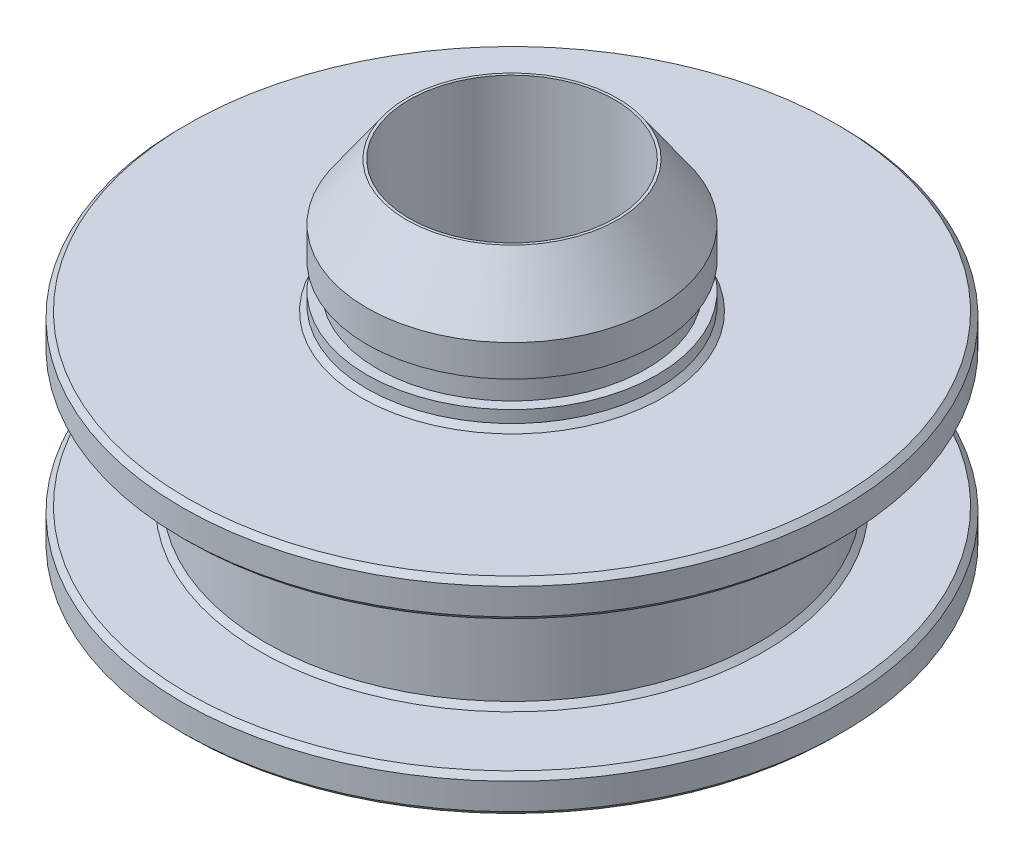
from build123d import *

# Parameters (mm, degrees)
SKETCH1_R          = 5.9436
EXTRUDE1_DEPTH     = 3.175
SKETCH2_R          = 7.9375
EXTRUDE2_DEPTH     = 0.889
SKETCH3_R          = 3.4925
EXTRUDE3_DEPTH     = 3.175
SKETCH4_W          = 0.254
SKETCH4_H          = 0.635
EXTRUDE4_START     = 0.889
SKETCH7_R          = 7.9375
EXTRUDE4_DEPTH     = 0.889
SKETCH8_R          = 4.445
EXTRUDE5_DEPTH     = 1.016
SKETCH5_R          = 2.4765
CUT_EXTRUDE1_DEPTH = 15.478278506
CHAMFER2_SIZE      = 0.127


with BuildPart() as part:
    # Sketch1 → Extrude1 (new body)
    with BuildSketch(Plane(origin=(0, 0, 0), x_dir=(1, 0, 0), z_dir=(0, 1, 0))):
        with Locations(Location((0, 0, 0), (0, 0, 270))):
            Circle(SKETCH1_R)
    extrude(amount=EXTRUDE1_DEPTH)

    # Sketch2 → Extrude2 (add)
    with BuildSketch(Plane(origin=(0, 3.175, 0), x_dir=(-1, 0, 0), z_dir=(0, 1, 0))):
        with Locations(Location((0, 0, 0), (0, 0, 90))):
            Circle(SKETCH2_R)
    extrude(amount=EXTRUDE2_DEPTH)

    # Sketch3 → Extrude3 (add)
    with BuildSketch(Plane(origin=(0, 4.064, 0), x_dir=(-1, 0, 0), z_dir=(0, 1, 0))):
        with Locations(Location((0, 0, 0), (0, 0, 90))):
            Circle(SKETCH3_R)
    extrude(amount=EXTRUDE3_DEPTH)

    # Sketch4 → Cut-Revolve1 (revolve, cut)
    with BuildSketch(Plane.XY, mode=Mode.PRIVATE) as cut_revolve1_sk:
        Polygon((-2.54, 7.239), (-3.4925, 5.878689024), (-3.4925, 7.239), align=None)
        with Locations((-3.3655, 4.799189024)):
            Rectangle(SKETCH4_W, SKETCH4_H)
    revolve(cut_revolve1_sk.sketch.rotate(Axis((0, 7.239, 0), (0, -1, 0)), 270), axis=Axis((0, 7.239, 0), (0, -1, 0)), mode=Mode.SUBTRACT)

    # Sketch7 → Extrude4 (add)
    with BuildSketch(Plane.XZ.offset(EXTRUDE4_START)):
        with Locations(Location((0, 0, 0), (0, 0, 90))):
            Circle(SKETCH7_R)
    extrude(amount=-EXTRUDE4_DEPTH)

    # Sketch8 → Extrude5 (add)
    with BuildSketch(Plane.XZ.offset(0.889)):
        with Locations(Location((0, 0, 0), (0, 0, 270))):
            Circle(SKETCH8_R)
    extrude(amount=EXTRUDE5_DEPTH)

    # Sketch5 → Cut-Extrude1 (cut, through all)
    with BuildSketch(Plane(origin=(0, 7.239, 0), x_dir=(-1, 0, 0), z_dir=(0, 1, 0))):
        with Locations(Location((0, 0, 0), (0, 0, 90))):
            Circle(SKETCH5_R)
    extrude(amount=-CUT_EXTRUDE1_DEPTH, mode=Mode.SUBTRACT)

    # Chamfer2
    chamfer2_edges = [part.edges().sort_by_distance(p)[0] for p in [
        (0, 4.064, -3.4925),
        (0, 0, -5.9436),
        (0, 0, -7.9375),
        (0, -0.889, -7.9375),
        (0, -0.889, 4.445),
        (0, -1.905, 4.445),
        (0, -1.905, -2.4765),
        (0, 3.175, -5.9436),
        (0, 3.175, -7.9375),
        (0, 4.064, -7.9375),
    ]]
    chamfer(chamfer2_edges, length=CHAMFER2_SIZE)


solid = part.part
